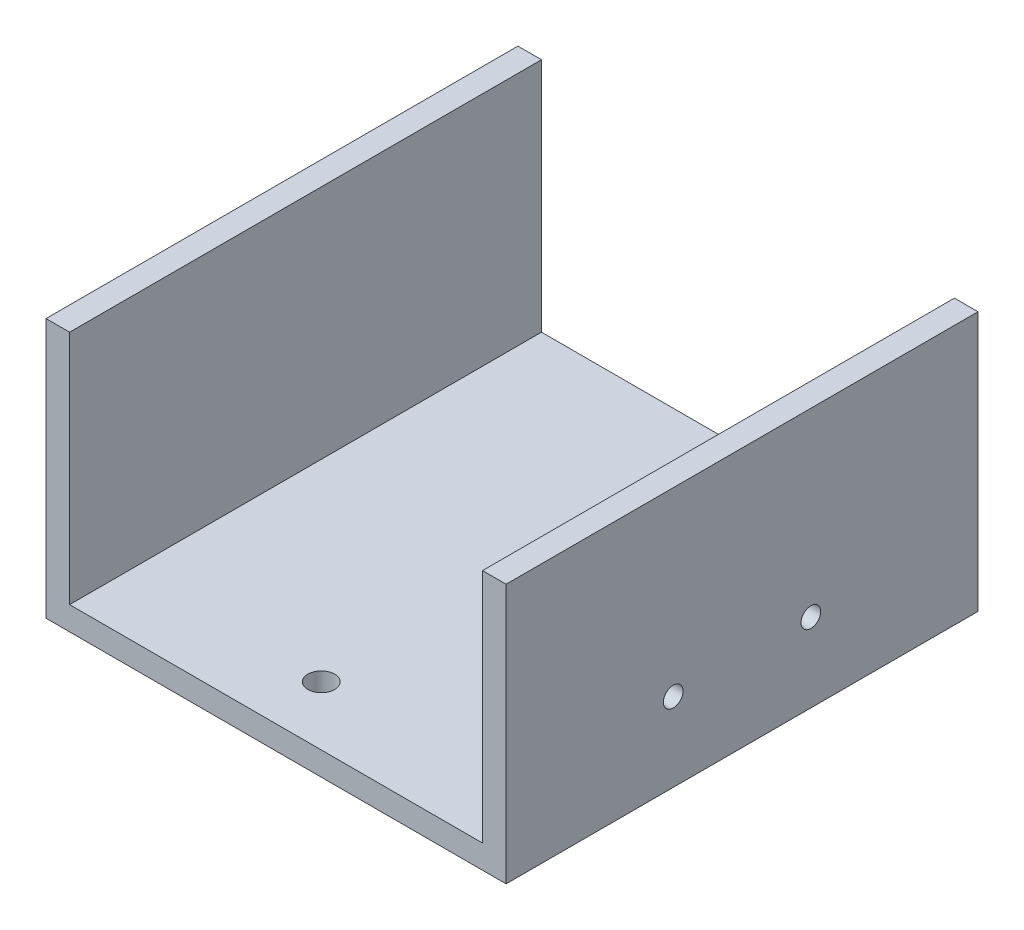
ISO-10303-21;
HEADER;
FILE_DESCRIPTION(('STEP AP214'),'2;1');
FILE_NAME('part.step','',(''),(''),'','','');
FILE_SCHEMA(('AUTOMOTIVE_DESIGN { 1 0 10303 214 1 1 1 1 }'));
ENDSEC;
DATA;
#1=APPLICATION_CONTEXT('core data for automotive mechanical design processes');
#2=APPLICATION_PROTOCOL_DEFINITION('international standard','automotive_design',2000,#1);
#3=PRODUCT_CONTEXT('',#1,'mechanical');
#4=PRODUCT('Part','Part','',(#3));
#5=PRODUCT_RELATED_PRODUCT_CATEGORY('part','',(#4));
#6=PRODUCT_DEFINITION_FORMATION('','',#4);
#7=PRODUCT_DEFINITION_CONTEXT('part definition',#1,'design');
#8=PRODUCT_DEFINITION('design','',#6,#7);
#9=PRODUCT_DEFINITION_SHAPE('','',#8);
#10=(LENGTH_UNIT() NAMED_UNIT(*) SI_UNIT(.MILLI.,.METRE.));
#11=(NAMED_UNIT(*) PLANE_ANGLE_UNIT() SI_UNIT($,.RADIAN.));
#12=(NAMED_UNIT(*) SI_UNIT($,.STERADIAN.) SOLID_ANGLE_UNIT());
#13=UNCERTAINTY_MEASURE_WITH_UNIT(LENGTH_MEASURE(1.E-05),#10,'distance_accuracy_value','');
#14=(GEOMETRIC_REPRESENTATION_CONTEXT(3) GLOBAL_UNCERTAINTY_ASSIGNED_CONTEXT((#13)) GLOBAL_UNIT_ASSIGNED_CONTEXT((#10,
#11,#12)) REPRESENTATION_CONTEXT('',''));
#15=CARTESIAN_POINT('',(0.,0.,0.));
#16=DIRECTION('',(0.,0.,1.));
#17=DIRECTION('',(1.,0.,0.));
#18=AXIS2_PLACEMENT_3D('',#15,#16,#17);
#19=CARTESIAN_POINT('',(52.5,-27.,120.));
#20=DIRECTION('',(1.,0.,0.));
#21=DIRECTION('',(0.,0.,-1.));
#22=AXIS2_PLACEMENT_3D('',#19,#20,#21);
#23=PLANE('',#22);
#24=CARTESIAN_POINT('',(52.5,-13.,42.5));
#25=DIRECTION('',(1.,0.,0.));
#26=DIRECTION('',(0.,0.,-1.));
#27=AXIS2_PLACEMENT_3D('',#24,#25,#26);
#28=CIRCLE('',#27,2.5);
#29=CARTESIAN_POINT('',(52.5,-13.,40.));
#30=VERTEX_POINT('',#29);
#31=EDGE_CURVE('E203',#30,#30,#28,.T.);
#32=ORIENTED_EDGE('',*,*,#31,.T.);
#33=EDGE_LOOP('',(#32));
#34=FACE_BOUND('',#33,.T.);
#35=CARTESIAN_POINT('',(52.5,-13.,77.5));
#36=DIRECTION('',(1.,0.,0.));
#37=DIRECTION('',(0.,0.,-1.));
#38=AXIS2_PLACEMENT_3D('',#35,#36,#37);
#39=CIRCLE('',#38,2.5);
#40=CARTESIAN_POINT('',(52.5,-13.,75.));
#41=VERTEX_POINT('',#40);
#42=EDGE_CURVE('E197',#41,#41,#39,.T.);
#43=ORIENTED_EDGE('',*,*,#42,.T.);
#44=EDGE_LOOP('',(#43));
#45=FACE_BOUND('',#44,.T.);
#46=DIRECTION('',(0.,-1.,0.));
#47=VECTOR('',#46,1.);
#48=CARTESIAN_POINT('',(52.5,-27.,0.));
#49=LINE('',#48,#47);
#50=CARTESIAN_POINT('',(52.5,33.,0.));
#51=VERTEX_POINT('',#50);
#52=CARTESIAN_POINT('',(52.5,-27.,0.));
#53=VERTEX_POINT('',#52);
#54=EDGE_CURVE('E126',#51,#53,#49,.T.);
#55=ORIENTED_EDGE('',*,*,#54,.T.);
#56=DIRECTION('',(0.,0.,-1.));
#57=VECTOR('',#56,1.);
#58=CARTESIAN_POINT('',(52.5,-27.,120.));
#59=LINE('',#58,#57);
#60=CARTESIAN_POINT('',(52.5,-27.,120.));
#61=VERTEX_POINT('',#60);
#62=EDGE_CURVE('E11',#61,#53,#59,.T.);
#63=ORIENTED_EDGE('',*,*,#62,.F.);
#64=DIRECTION('',(0.,-1.,0.));
#65=VECTOR('',#64,1.);
#66=CARTESIAN_POINT('',(52.5,-27.,120.));
#67=LINE('',#66,#65);
#68=CARTESIAN_POINT('',(52.5,33.,120.));
#69=VERTEX_POINT('',#68);
#70=EDGE_CURVE('E141',#69,#61,#67,.T.);
#71=ORIENTED_EDGE('',*,*,#70,.F.);
#72=DIRECTION('',(0.,0.,-1.));
#73=VECTOR('',#72,1.);
#74=CARTESIAN_POINT('',(52.5,33.,120.));
#75=LINE('',#74,#73);
#76=EDGE_CURVE('E122',#69,#51,#75,.T.);
#77=ORIENTED_EDGE('',*,*,#76,.T.);
#78=EDGE_LOOP('',(#55,#63,#71,#77));
#79=FACE_BOUND('',#78,.T.);
#80=ADVANCED_FACE('F30',(#34,#45,#79),#23,.F.);
#81=CARTESIAN_POINT('',(-52.5,-27.,120.));
#82=DIRECTION('',(0.,-1.,0.));
#83=DIRECTION('',(0.,0.,-1.));
#84=AXIS2_PLACEMENT_3D('',#81,#82,#83);
#85=PLANE('',#84);
#86=CARTESIAN_POINT('',(46.5,-27.,15.));
#87=DIRECTION('',(0.,-1.,0.));
#88=DIRECTION('',(0.,0.,-1.));
#89=AXIS2_PLACEMENT_3D('',#86,#87,#88);
#90=CIRCLE('',#89,3.39999999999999);
#91=CARTESIAN_POINT('',(46.5,-27.,11.6));
#92=VERTEX_POINT('',#91);
#93=EDGE_CURVE('E191',#92,#92,#90,.T.);
#94=ORIENTED_EDGE('',*,*,#93,.T.);
#95=EDGE_LOOP('',(#94));
#96=FACE_BOUND('',#95,.T.);
#97=CARTESIAN_POINT('',(-3.5,-27.,15.));
#98=DIRECTION('',(0.,-1.,0.));
#99=DIRECTION('',(0.,0.,-1.));
#100=AXIS2_PLACEMENT_3D('',#97,#98,#99);
#101=CIRCLE('',#100,3.39999999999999);
#102=CARTESIAN_POINT('',(-3.5,-27.,11.6));
#103=VERTEX_POINT('',#102);
#104=EDGE_CURVE('E185',#103,#103,#101,.T.);
#105=ORIENTED_EDGE('',*,*,#104,.T.);
#106=EDGE_LOOP('',(#105));
#107=FACE_BOUND('',#106,.T.);
#108=CARTESIAN_POINT('',(46.5,-27.,105.));
#109=DIRECTION('',(0.,-1.,0.));
#110=DIRECTION('',(0.,0.,-1.));
#111=AXIS2_PLACEMENT_3D('',#108,#109,#110);
#112=CIRCLE('',#111,3.39999999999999);
#113=CARTESIAN_POINT('',(46.5,-27.,101.6));
#114=VERTEX_POINT('',#113);
#115=EDGE_CURVE('E179',#114,#114,#112,.T.);
#116=ORIENTED_EDGE('',*,*,#115,.T.);
#117=EDGE_LOOP('',(#116));
#118=FACE_BOUND('',#117,.T.);
#119=CARTESIAN_POINT('',(-3.5,-27.,105.));
#120=DIRECTION('',(0.,-1.,0.));
#121=DIRECTION('',(0.,0.,-1.));
#122=AXIS2_PLACEMENT_3D('',#119,#120,#121);
#123=CIRCLE('',#122,3.39999999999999);
#124=CARTESIAN_POINT('',(-3.5,-27.,101.6));
#125=VERTEX_POINT('',#124);
#126=EDGE_CURVE('E130',#125,#125,#123,.T.);
#127=ORIENTED_EDGE('',*,*,#126,.T.);
#128=EDGE_LOOP('',(#127));
#129=FACE_BOUND('',#128,.T.);
#130=DIRECTION('',(-1.,0.,0.));
#131=VECTOR('',#130,1.);
#132=CARTESIAN_POINT('',(-52.5,-27.,0.));
#133=LINE('',#132,#131);
#134=CARTESIAN_POINT('',(-52.5,-27.,0.));
#135=VERTEX_POINT('',#134);
#136=EDGE_CURVE('E129',#53,#135,#133,.T.);
#137=ORIENTED_EDGE('',*,*,#136,.T.);
#138=DIRECTION('',(0.,0.,-1.));
#139=VECTOR('',#138,1.);
#140=CARTESIAN_POINT('',(-52.5,-27.,120.));
#141=LINE('',#140,#139);
#142=CARTESIAN_POINT('',(-52.5,-27.,120.));
#143=VERTEX_POINT('',#142);
#144=EDGE_CURVE('E38',#143,#135,#141,.T.);
#145=ORIENTED_EDGE('',*,*,#144,.F.);
#146=DIRECTION('',(-1.,0.,0.));
#147=VECTOR('',#146,1.);
#148=CARTESIAN_POINT('',(-52.5,-27.,120.));
#149=LINE('',#148,#147);
#150=EDGE_CURVE('E89',#61,#143,#149,.T.);
#151=ORIENTED_EDGE('',*,*,#150,.F.);
#152=ORIENTED_EDGE('',*,*,#62,.T.);
#153=EDGE_LOOP('',(#137,#145,#151,#152));
#154=FACE_BOUND('',#153,.T.);
#155=ADVANCED_FACE('F228',(#96,#107,#118,#129,#154),#85,.F.);
#156=CARTESIAN_POINT('',(-52.5,-27.,120.));
#157=DIRECTION('',(-1.,0.,0.));
#158=DIRECTION('',(0.,-1.,0.));
#159=AXIS2_PLACEMENT_3D('',#156,#157,#158);
#160=PLANE('',#159);
#161=DIRECTION('',(0.,1.,0.));
#162=VECTOR('',#161,1.);
#163=CARTESIAN_POINT('',(-52.5,-27.,0.));
#164=LINE('',#163,#162);
#165=CARTESIAN_POINT('',(-52.5,33.,0.));
#166=VERTEX_POINT('',#165);
#167=EDGE_CURVE('E132',#135,#166,#164,.T.);
#168=ORIENTED_EDGE('',*,*,#167,.T.);
#169=DIRECTION('',(0.,0.,-1.));
#170=VECTOR('',#169,1.);
#171=CARTESIAN_POINT('',(-52.5,33.,120.));
#172=LINE('',#171,#170);
#173=CARTESIAN_POINT('',(-52.5,33.,120.));
#174=VERTEX_POINT('',#173);
#175=EDGE_CURVE('E148',#174,#166,#172,.T.);
#176=ORIENTED_EDGE('',*,*,#175,.F.);
#177=DIRECTION('',(0.,1.,0.));
#178=VECTOR('',#177,1.);
#179=CARTESIAN_POINT('',(-52.5,-27.,120.));
#180=LINE('',#179,#178);
#181=EDGE_CURVE('E156',#143,#174,#180,.T.);
#182=ORIENTED_EDGE('',*,*,#181,.F.);
#183=ORIENTED_EDGE('',*,*,#144,.T.);
#184=EDGE_LOOP('',(#168,#176,#182,#183));
#185=FACE_BOUND('',#184,.T.);
#186=ADVANCED_FACE('F154',(#185),#160,.F.);
#187=CARTESIAN_POINT('',(-52.5,33.,120.));
#188=DIRECTION('',(0.,-1.,0.));
#189=DIRECTION('',(1.,0.,0.));
#190=AXIS2_PLACEMENT_3D('',#187,#188,#189);
#191=PLANE('',#190);
#192=DIRECTION('',(-1.,0.,0.));
#193=VECTOR('',#192,1.);
#194=CARTESIAN_POINT('',(-52.5,33.,0.));
#195=LINE('',#194,#193);
#196=CARTESIAN_POINT('',(-58.5,33.,0.));
#197=VERTEX_POINT('',#196);
#198=EDGE_CURVE('E134',#166,#197,#195,.T.);
#199=ORIENTED_EDGE('',*,*,#198,.T.);
#200=DIRECTION('',(0.,0.,-1.));
#201=VECTOR('',#200,1.);
#202=CARTESIAN_POINT('',(-58.5,33.,120.));
#203=LINE('',#202,#201);
#204=CARTESIAN_POINT('',(-58.5,33.,120.));
#205=VERTEX_POINT('',#204);
#206=EDGE_CURVE('E145',#205,#197,#203,.T.);
#207=ORIENTED_EDGE('',*,*,#206,.F.);
#208=DIRECTION('',(-1.,0.,0.));
#209=VECTOR('',#208,1.);
#210=CARTESIAN_POINT('',(-52.5,33.,120.));
#211=LINE('',#210,#209);
#212=EDGE_CURVE('E168',#174,#205,#211,.T.);
#213=ORIENTED_EDGE('',*,*,#212,.F.);
#214=ORIENTED_EDGE('',*,*,#175,.T.);
#215=EDGE_LOOP('',(#199,#207,#213,#214));
#216=FACE_BOUND('',#215,.T.);
#217=ADVANCED_FACE('F164',(#216),#191,.F.);
#218=CARTESIAN_POINT('',(-58.5,33.,120.));
#219=DIRECTION('',(1.,0.,0.));
#220=DIRECTION('',(0.,1.,0.));
#221=AXIS2_PLACEMENT_3D('',#218,#219,#220);
#222=PLANE('',#221);
#223=DIRECTION('',(0.,-1.,0.));
#224=VECTOR('',#223,1.);
#225=CARTESIAN_POINT('',(-58.5,33.,0.));
#226=LINE('',#225,#224);
#227=CARTESIAN_POINT('',(-58.5,-33.,0.));
#228=VERTEX_POINT('',#227);
#229=EDGE_CURVE('E136',#197,#228,#226,.T.);
#230=ORIENTED_EDGE('',*,*,#229,.T.);
#231=DIRECTION('',(0.,0.,-1.));
#232=VECTOR('',#231,1.);
#233=CARTESIAN_POINT('',(-58.5,-33.,120.));
#234=LINE('',#233,#232);
#235=CARTESIAN_POINT('',(-58.5,-33.,120.));
#236=VERTEX_POINT('',#235);
#237=EDGE_CURVE('E117',#236,#228,#234,.T.);
#238=ORIENTED_EDGE('',*,*,#237,.F.);
#239=DIRECTION('',(0.,-1.,0.));
#240=VECTOR('',#239,1.);
#241=CARTESIAN_POINT('',(-58.5,33.,120.));
#242=LINE('',#241,#240);
#243=EDGE_CURVE('E108',#205,#236,#242,.T.);
#244=ORIENTED_EDGE('',*,*,#243,.F.);
#245=ORIENTED_EDGE('',*,*,#206,.T.);
#246=EDGE_LOOP('',(#230,#238,#244,#245));
#247=FACE_BOUND('',#246,.T.);
#248=ADVANCED_FACE('F167',(#247),#222,.F.);
#249=CARTESIAN_POINT('',(58.5,-33.,120.));
#250=DIRECTION('',(0.,1.,0.));
#251=DIRECTION('',(-1.,0.,0.));
#252=AXIS2_PLACEMENT_3D('',#249,#250,#251);
#253=PLANE('',#252);
#254=CARTESIAN_POINT('',(46.5,-33.,15.));
#255=DIRECTION('',(0.,-1.,0.));
#256=DIRECTION('',(0.,0.,-1.));
#257=AXIS2_PLACEMENT_3D('',#254,#255,#256);
#258=CIRCLE('',#257,3.39999999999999);
#259=CARTESIAN_POINT('',(46.5,-33.,11.6));
#260=VERTEX_POINT('',#259);
#261=EDGE_CURVE('E194',#260,#260,#258,.T.);
#262=ORIENTED_EDGE('',*,*,#261,.F.);
#263=EDGE_LOOP('',(#262));
#264=FACE_BOUND('',#263,.T.);
#265=CARTESIAN_POINT('',(-3.5,-33.,15.));
#266=DIRECTION('',(0.,-1.,0.));
#267=DIRECTION('',(0.,0.,-1.));
#268=AXIS2_PLACEMENT_3D('',#265,#266,#267);
#269=CIRCLE('',#268,3.39999999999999);
#270=CARTESIAN_POINT('',(-3.5,-33.,11.6));
#271=VERTEX_POINT('',#270);
#272=EDGE_CURVE('E188',#271,#271,#269,.T.);
#273=ORIENTED_EDGE('',*,*,#272,.F.);
#274=EDGE_LOOP('',(#273));
#275=FACE_BOUND('',#274,.T.);
#276=CARTESIAN_POINT('',(46.5,-33.,105.));
#277=DIRECTION('',(0.,-1.,0.));
#278=DIRECTION('',(0.,0.,-1.));
#279=AXIS2_PLACEMENT_3D('',#276,#277,#278);
#280=CIRCLE('',#279,3.39999999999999);
#281=CARTESIAN_POINT('',(46.5,-33.,101.6));
#282=VERTEX_POINT('',#281);
#283=EDGE_CURVE('E182',#282,#282,#280,.T.);
#284=ORIENTED_EDGE('',*,*,#283,.F.);
#285=EDGE_LOOP('',(#284));
#286=FACE_BOUND('',#285,.T.);
#287=CARTESIAN_POINT('',(-3.5,-33.,105.));
#288=DIRECTION('',(0.,-1.,0.));
#289=DIRECTION('',(0.,0.,-1.));
#290=AXIS2_PLACEMENT_3D('',#287,#288,#289);
#291=CIRCLE('',#290,3.39999999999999);
#292=CARTESIAN_POINT('',(-3.5,-33.,101.6));
#293=VERTEX_POINT('',#292);
#294=EDGE_CURVE('E176',#293,#293,#291,.T.);
#295=ORIENTED_EDGE('',*,*,#294,.F.);
#296=EDGE_LOOP('',(#295));
#297=FACE_BOUND('',#296,.T.);
#298=DIRECTION('',(1.,0.,0.));
#299=VECTOR('',#298,1.);
#300=CARTESIAN_POINT('',(58.5,-33.,0.));
#301=LINE('',#300,#299);
#302=CARTESIAN_POINT('',(58.5,-33.,0.));
#303=VERTEX_POINT('',#302);
#304=EDGE_CURVE('E116',#228,#303,#301,.T.);
#305=ORIENTED_EDGE('',*,*,#304,.T.);
#306=DIRECTION('',(0.,0.,-1.));
#307=VECTOR('',#306,1.);
#308=CARTESIAN_POINT('',(58.5,-33.,120.));
#309=LINE('',#308,#307);
#310=CARTESIAN_POINT('',(58.5,-33.,120.));
#311=VERTEX_POINT('',#310);
#312=EDGE_CURVE('E113',#311,#303,#309,.T.);
#313=ORIENTED_EDGE('',*,*,#312,.F.);
#314=DIRECTION('',(1.,0.,0.));
#315=VECTOR('',#314,1.);
#316=CARTESIAN_POINT('',(58.5,-33.,120.));
#317=LINE('',#316,#315);
#318=EDGE_CURVE('E102',#236,#311,#317,.T.);
#319=ORIENTED_EDGE('',*,*,#318,.F.);
#320=ORIENTED_EDGE('',*,*,#237,.T.);
#321=EDGE_LOOP('',(#305,#313,#319,#320));
#322=FACE_BOUND('',#321,.T.);
#323=ADVANCED_FACE('F114',(#264,#275,#286,#297,#322),#253,.F.);
#324=CARTESIAN_POINT('',(58.5,33.,120.));
#325=DIRECTION('',(-1.,0.,0.));
#326=DIRECTION('',(0.,0.,1.));
#327=AXIS2_PLACEMENT_3D('',#324,#325,#326);
#328=PLANE('',#327);
#329=CARTESIAN_POINT('',(58.5,-13.,42.5));
#330=DIRECTION('',(1.,0.,0.));
#331=DIRECTION('',(0.,0.,-1.));
#332=AXIS2_PLACEMENT_3D('',#329,#330,#331);
#333=CIRCLE('',#332,2.5);
#334=CARTESIAN_POINT('',(58.5,-13.,40.));
#335=VERTEX_POINT('',#334);
#336=EDGE_CURVE('E206',#335,#335,#333,.T.);
#337=ORIENTED_EDGE('',*,*,#336,.F.);
#338=EDGE_LOOP('',(#337));
#339=FACE_BOUND('',#338,.T.);
#340=CARTESIAN_POINT('',(58.5,-13.,77.5));
#341=DIRECTION('',(1.,0.,0.));
#342=DIRECTION('',(0.,0.,-1.));
#343=AXIS2_PLACEMENT_3D('',#340,#341,#342);
#344=CIRCLE('',#343,2.5);
#345=CARTESIAN_POINT('',(58.5,-13.,75.));
#346=VERTEX_POINT('',#345);
#347=EDGE_CURVE('E200',#346,#346,#344,.T.);
#348=ORIENTED_EDGE('',*,*,#347,.F.);
#349=EDGE_LOOP('',(#348));
#350=FACE_BOUND('',#349,.T.);
#351=DIRECTION('',(0.,1.,0.));
#352=VECTOR('',#351,1.);
#353=CARTESIAN_POINT('',(58.5,33.,0.));
#354=LINE('',#353,#352);
#355=CARTESIAN_POINT('',(58.5,33.,0.));
#356=VERTEX_POINT('',#355);
#357=EDGE_CURVE('E75',#303,#356,#354,.T.);
#358=ORIENTED_EDGE('',*,*,#357,.T.);
#359=DIRECTION('',(0.,0.,-1.));
#360=VECTOR('',#359,1.);
#361=CARTESIAN_POINT('',(58.5,33.,120.));
#362=LINE('',#361,#360);
#363=CARTESIAN_POINT('',(58.5,33.,120.));
#364=VERTEX_POINT('',#363);
#365=EDGE_CURVE('E118',#364,#356,#362,.T.);
#366=ORIENTED_EDGE('',*,*,#365,.F.);
#367=DIRECTION('',(0.,1.,0.));
#368=VECTOR('',#367,1.);
#369=CARTESIAN_POINT('',(58.5,33.,120.));
#370=LINE('',#369,#368);
#371=EDGE_CURVE('E106',#311,#364,#370,.T.);
#372=ORIENTED_EDGE('',*,*,#371,.F.);
#373=ORIENTED_EDGE('',*,*,#312,.T.);
#374=EDGE_LOOP('',(#358,#366,#372,#373));
#375=FACE_BOUND('',#374,.T.);
#376=ADVANCED_FACE('F120',(#339,#350,#375),#328,.F.);
#377=CARTESIAN_POINT('',(52.5,33.,120.));
#378=DIRECTION('',(0.,-1.,0.));
#379=DIRECTION('',(1.,0.,0.));
#380=AXIS2_PLACEMENT_3D('',#377,#378,#379);
#381=PLANE('',#380);
#382=DIRECTION('',(-1.,0.,0.));
#383=VECTOR('',#382,1.);
#384=CARTESIAN_POINT('',(52.5,33.,0.));
#385=LINE('',#384,#383);
#386=EDGE_CURVE('E81',#356,#51,#385,.T.);
#387=ORIENTED_EDGE('',*,*,#386,.T.);
#388=ORIENTED_EDGE('',*,*,#76,.F.);
#389=DIRECTION('',(-1.,0.,0.));
#390=VECTOR('',#389,1.);
#391=CARTESIAN_POINT('',(52.5,33.,120.));
#392=LINE('',#391,#390);
#393=EDGE_CURVE('E46',#364,#69,#392,.T.);
#394=ORIENTED_EDGE('',*,*,#393,.F.);
#395=ORIENTED_EDGE('',*,*,#365,.T.);
#396=EDGE_LOOP('',(#387,#388,#394,#395));
#397=FACE_BOUND('',#396,.T.);
#398=ADVANCED_FACE('F215',(#397),#381,.F.);
#399=CARTESIAN_POINT('',(52.5,33.,120.));
#400=DIRECTION('',(0.,0.,-1.));
#401=DIRECTION('',(-1.,0.,0.));
#402=AXIS2_PLACEMENT_3D('',#399,#400,#401);
#403=PLANE('',#402);
#404=ORIENTED_EDGE('',*,*,#70,.T.);
#405=ORIENTED_EDGE('',*,*,#150,.T.);
#406=ORIENTED_EDGE('',*,*,#181,.T.);
#407=ORIENTED_EDGE('',*,*,#212,.T.);
#408=ORIENTED_EDGE('',*,*,#243,.T.);
#409=ORIENTED_EDGE('',*,*,#318,.T.);
#410=ORIENTED_EDGE('',*,*,#371,.T.);
#411=ORIENTED_EDGE('',*,*,#393,.T.);
#412=EDGE_LOOP('',(#404,#405,#406,#407,#408,#409,#410,#411));
#413=FACE_BOUND('',#412,.T.);
#414=ADVANCED_FACE('F104',(#413),#403,.F.);
#415=CARTESIAN_POINT('',(52.5,33.,0.));
#416=DIRECTION('',(0.,0.,-1.));
#417=DIRECTION('',(-1.,0.,0.));
#418=AXIS2_PLACEMENT_3D('',#415,#416,#417);
#419=PLANE('',#418);
#420=ORIENTED_EDGE('',*,*,#54,.F.);
#421=ORIENTED_EDGE('',*,*,#386,.F.);
#422=ORIENTED_EDGE('',*,*,#357,.F.);
#423=ORIENTED_EDGE('',*,*,#304,.F.);
#424=ORIENTED_EDGE('',*,*,#229,.F.);
#425=ORIENTED_EDGE('',*,*,#198,.F.);
#426=ORIENTED_EDGE('',*,*,#167,.F.);
#427=ORIENTED_EDGE('',*,*,#136,.F.);
#428=EDGE_LOOP('',(#420,#421,#422,#423,#424,#425,#426,#427));
#429=FACE_BOUND('',#428,.T.);
#430=ADVANCED_FACE('F160',(#429),#419,.T.);
#431=CARTESIAN_POINT('',(-3.5,-33.,105.));
#432=DIRECTION('',(0.,-1.,0.));
#433=DIRECTION('',(0.,0.,-1.));
#434=AXIS2_PLACEMENT_3D('',#431,#432,#433);
#435=CYLINDRICAL_SURFACE('',#434,3.39999999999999);
#436=ORIENTED_EDGE('',*,*,#294,.T.);
#437=EDGE_LOOP('',(#436));
#438=FACE_BOUND('',#437,.T.);
#439=ORIENTED_EDGE('',*,*,#126,.F.);
#440=EDGE_LOOP('',(#439));
#441=FACE_BOUND('',#440,.T.);
#442=ADVANCED_FACE('F260',(#438,#441),#435,.F.);
#443=CARTESIAN_POINT('',(46.5,-33.,105.));
#444=DIRECTION('',(0.,-1.,0.));
#445=DIRECTION('',(0.,0.,-1.));
#446=AXIS2_PLACEMENT_3D('',#443,#444,#445);
#447=CYLINDRICAL_SURFACE('',#446,3.39999999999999);
#448=ORIENTED_EDGE('',*,*,#283,.T.);
#449=EDGE_LOOP('',(#448));
#450=FACE_BOUND('',#449,.T.);
#451=ORIENTED_EDGE('',*,*,#115,.F.);
#452=EDGE_LOOP('',(#451));
#453=FACE_BOUND('',#452,.T.);
#454=ADVANCED_FACE('F262',(#450,#453),#447,.F.);
#455=CARTESIAN_POINT('',(-3.5,-33.,15.));
#456=DIRECTION('',(0.,-1.,0.));
#457=DIRECTION('',(0.,0.,-1.));
#458=AXIS2_PLACEMENT_3D('',#455,#456,#457);
#459=CYLINDRICAL_SURFACE('',#458,3.39999999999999);
#460=ORIENTED_EDGE('',*,*,#272,.T.);
#461=EDGE_LOOP('',(#460));
#462=FACE_BOUND('',#461,.T.);
#463=ORIENTED_EDGE('',*,*,#104,.F.);
#464=EDGE_LOOP('',(#463));
#465=FACE_BOUND('',#464,.T.);
#466=ADVANCED_FACE('F269',(#462,#465),#459,.F.);
#467=CARTESIAN_POINT('',(46.5,-33.,15.));
#468=DIRECTION('',(0.,-1.,0.));
#469=DIRECTION('',(0.,0.,-1.));
#470=AXIS2_PLACEMENT_3D('',#467,#468,#469);
#471=CYLINDRICAL_SURFACE('',#470,3.39999999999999);
#472=ORIENTED_EDGE('',*,*,#261,.T.);
#473=EDGE_LOOP('',(#472));
#474=FACE_BOUND('',#473,.T.);
#475=ORIENTED_EDGE('',*,*,#93,.F.);
#476=EDGE_LOOP('',(#475));
#477=FACE_BOUND('',#476,.T.);
#478=ADVANCED_FACE('F222',(#474,#477),#471,.F.);
#479=CARTESIAN_POINT('',(58.5,-13.,77.5));
#480=DIRECTION('',(1.,0.,0.));
#481=DIRECTION('',(0.,0.,-1.));
#482=AXIS2_PLACEMENT_3D('',#479,#480,#481);
#483=CYLINDRICAL_SURFACE('',#482,2.5);
#484=ORIENTED_EDGE('',*,*,#347,.T.);
#485=EDGE_LOOP('',(#484));
#486=FACE_BOUND('',#485,.T.);
#487=ORIENTED_EDGE('',*,*,#42,.F.);
#488=EDGE_LOOP('',(#487));
#489=FACE_BOUND('',#488,.T.);
#490=ADVANCED_FACE('F219',(#486,#489),#483,.F.);
#491=CARTESIAN_POINT('',(58.5,-13.,42.5));
#492=DIRECTION('',(1.,0.,0.));
#493=DIRECTION('',(0.,0.,-1.));
#494=AXIS2_PLACEMENT_3D('',#491,#492,#493);
#495=CYLINDRICAL_SURFACE('',#494,2.5);
#496=ORIENTED_EDGE('',*,*,#336,.T.);
#497=EDGE_LOOP('',(#496));
#498=FACE_BOUND('',#497,.T.);
#499=ORIENTED_EDGE('',*,*,#31,.F.);
#500=EDGE_LOOP('',(#499));
#501=FACE_BOUND('',#500,.T.);
#502=ADVANCED_FACE('F210',(#498,#501),#495,.F.);
#503=CLOSED_SHELL('',(#80,#155,#186,#217,#248,#323,#376,#398,#414,#430,#442,#454,#466,#478,#490,#502));
#504=MANIFOLD_SOLID_BREP('B2',#503);
#505=ADVANCED_BREP_SHAPE_REPRESENTATION('',(#18,#504),#14);
#506=SHAPE_DEFINITION_REPRESENTATION(#9,#505);
ENDSEC;
END-ISO-10303-21;
